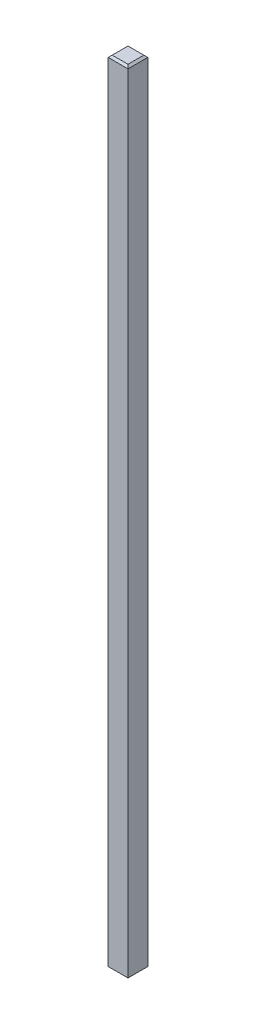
ISO-10303-21;
HEADER;
FILE_DESCRIPTION(('STEP AP214'),'2;1');
FILE_NAME('part.step','',(''),(''),'','','');
FILE_SCHEMA(('AUTOMOTIVE_DESIGN { 1 0 10303 214 1 1 1 1 }'));
ENDSEC;
DATA;
#1=APPLICATION_CONTEXT('core data for automotive mechanical design processes');
#2=APPLICATION_PROTOCOL_DEFINITION('international standard','automotive_design',2000,#1);
#3=PRODUCT_CONTEXT('',#1,'mechanical');
#4=PRODUCT('Part','Part','',(#3));
#5=PRODUCT_RELATED_PRODUCT_CATEGORY('part','',(#4));
#6=PRODUCT_DEFINITION_FORMATION('','',#4);
#7=PRODUCT_DEFINITION_CONTEXT('part definition',#1,'design');
#8=PRODUCT_DEFINITION('design','',#6,#7);
#9=PRODUCT_DEFINITION_SHAPE('','',#8);
#10=(LENGTH_UNIT() NAMED_UNIT(*) SI_UNIT(.MILLI.,.METRE.));
#11=(NAMED_UNIT(*) PLANE_ANGLE_UNIT() SI_UNIT($,.RADIAN.));
#12=(NAMED_UNIT(*) SI_UNIT($,.STERADIAN.) SOLID_ANGLE_UNIT());
#13=UNCERTAINTY_MEASURE_WITH_UNIT(LENGTH_MEASURE(1.E-05),#10,'distance_accuracy_value','');
#14=(GEOMETRIC_REPRESENTATION_CONTEXT(3) GLOBAL_UNCERTAINTY_ASSIGNED_CONTEXT((#13)) GLOBAL_UNIT_ASSIGNED_CONTEXT((#10,
#11,#12)) REPRESENTATION_CONTEXT('',''));
#15=CARTESIAN_POINT('',(0.,0.,0.));
#16=DIRECTION('',(0.,0.,1.));
#17=DIRECTION('',(1.,0.,0.));
#18=AXIS2_PLACEMENT_3D('',#15,#16,#17);
#19=CARTESIAN_POINT('',(0.,0.,10.));
#20=DIRECTION('',(1.,0.,0.));
#21=DIRECTION('',(0.,0.,-1.));
#22=AXIS2_PLACEMENT_3D('',#19,#20,#21);
#23=PLANE('',#22);
#24=DIRECTION('',(0.,-1.,0.));
#25=VECTOR('',#24,1.);
#26=CARTESIAN_POINT('',(0.,0.,10.));
#27=LINE('',#26,#25);
#28=CARTESIAN_POINT('',(0.,399.,10.));
#29=VERTEX_POINT('',#28);
#30=CARTESIAN_POINT('',(0.,1.,10.));
#31=VERTEX_POINT('',#30);
#32=EDGE_CURVE('E210',#29,#31,#27,.T.);
#33=ORIENTED_EDGE('',*,*,#32,.F.);
#34=DIRECTION('',(0.,0.,-1.));
#35=VECTOR('',#34,1.);
#36=CARTESIAN_POINT('',(0.,399.,10.));
#37=LINE('',#36,#35);
#38=CARTESIAN_POINT('',(0.,399.,0.));
#39=VERTEX_POINT('',#38);
#40=EDGE_CURVE('E154',#29,#39,#37,.T.);
#41=ORIENTED_EDGE('',*,*,#40,.T.);
#42=DIRECTION('',(0.,-1.,0.));
#43=VECTOR('',#42,1.);
#44=CARTESIAN_POINT('',(0.,0.,0.));
#45=LINE('',#44,#43);
#46=CARTESIAN_POINT('',(0.,1.,0.));
#47=VERTEX_POINT('',#46);
#48=EDGE_CURVE('E178',#39,#47,#45,.T.);
#49=ORIENTED_EDGE('',*,*,#48,.T.);
#50=DIRECTION('',(0.,0.,1.));
#51=VECTOR('',#50,1.);
#52=CARTESIAN_POINT('',(0.,1.,10.));
#53=LINE('',#52,#51);
#54=EDGE_CURVE('E150',#47,#31,#53,.T.);
#55=ORIENTED_EDGE('',*,*,#54,.T.);
#56=EDGE_LOOP('',(#33,#41,#49,#55));
#57=FACE_BOUND('',#56,.T.);
#58=ADVANCED_FACE('F39',(#57),#23,.F.);
#59=CARTESIAN_POINT('',(0.,0.,10.));
#60=DIRECTION('',(0.,1.,0.));
#61=DIRECTION('',(0.,0.,1.));
#62=AXIS2_PLACEMENT_3D('',#59,#60,#61);
#63=PLANE('',#62);
#64=DIRECTION('',(-1.,0.,0.));
#65=VECTOR('',#64,1.);
#66=CARTESIAN_POINT('',(0.,0.,9.));
#67=LINE('',#66,#65);
#68=CARTESIAN_POINT('',(9.,0.,9.));
#69=VERTEX_POINT('',#68);
#70=CARTESIAN_POINT('',(1.,0.,9.));
#71=VERTEX_POINT('',#70);
#72=EDGE_CURVE('E49',#69,#71,#67,.T.);
#73=ORIENTED_EDGE('',*,*,#72,.T.);
#74=DIRECTION('',(0.,0.,-1.));
#75=VECTOR('',#74,1.);
#76=CARTESIAN_POINT('',(1.,0.,10.));
#77=LINE('',#76,#75);
#78=CARTESIAN_POINT('',(1.,0.,1.));
#79=VERTEX_POINT('',#78);
#80=EDGE_CURVE('E11',#71,#79,#77,.T.);
#81=ORIENTED_EDGE('',*,*,#80,.T.);
#82=DIRECTION('',(1.,0.,0.));
#83=VECTOR('',#82,1.);
#84=CARTESIAN_POINT('',(10.,0.,1.));
#85=LINE('',#84,#83);
#86=CARTESIAN_POINT('',(9.,0.,1.));
#87=VERTEX_POINT('',#86);
#88=EDGE_CURVE('E163',#79,#87,#85,.T.);
#89=ORIENTED_EDGE('',*,*,#88,.T.);
#90=DIRECTION('',(0.,0.,1.));
#91=VECTOR('',#90,1.);
#92=CARTESIAN_POINT('',(9.,0.,10.));
#93=LINE('',#92,#91);
#94=EDGE_CURVE('E60',#87,#69,#93,.T.);
#95=ORIENTED_EDGE('',*,*,#94,.T.);
#96=EDGE_LOOP('',(#73,#81,#89,#95));
#97=FACE_BOUND('',#96,.T.);
#98=ADVANCED_FACE('F237',(#97),#63,.F.);
#99=CARTESIAN_POINT('',(10.,0.,10.));
#100=DIRECTION('',(-1.,0.,0.));
#101=DIRECTION('',(0.,0.,1.));
#102=AXIS2_PLACEMENT_3D('',#99,#100,#101);
#103=PLANE('',#102);
#104=DIRECTION('',(0.,1.,0.));
#105=VECTOR('',#104,1.);
#106=CARTESIAN_POINT('',(10.,0.,0.));
#107=LINE('',#106,#105);
#108=CARTESIAN_POINT('',(10.,1.,0.));
#109=VERTEX_POINT('',#108);
#110=CARTESIAN_POINT('',(10.,399.,0.));
#111=VERTEX_POINT('',#110);
#112=EDGE_CURVE('E203',#109,#111,#107,.T.);
#113=ORIENTED_EDGE('',*,*,#112,.T.);
#114=DIRECTION('',(0.,0.,1.));
#115=VECTOR('',#114,1.);
#116=CARTESIAN_POINT('',(10.,399.,10.));
#117=LINE('',#116,#115);
#118=CARTESIAN_POINT('',(10.,399.,10.));
#119=VERTEX_POINT('',#118);
#120=EDGE_CURVE('E112',#111,#119,#117,.T.);
#121=ORIENTED_EDGE('',*,*,#120,.T.);
#122=DIRECTION('',(0.,1.,0.));
#123=VECTOR('',#122,1.);
#124=CARTESIAN_POINT('',(10.,0.,10.));
#125=LINE('',#124,#123);
#126=CARTESIAN_POINT('',(10.,1.,10.));
#127=VERTEX_POINT('',#126);
#128=EDGE_CURVE('E127',#127,#119,#125,.T.);
#129=ORIENTED_EDGE('',*,*,#128,.F.);
#130=DIRECTION('',(0.,0.,-1.));
#131=VECTOR('',#130,1.);
#132=CARTESIAN_POINT('',(10.,1.,10.));
#133=LINE('',#132,#131);
#134=EDGE_CURVE('E134',#127,#109,#133,.T.);
#135=ORIENTED_EDGE('',*,*,#134,.T.);
#136=EDGE_LOOP('',(#113,#121,#129,#135));
#137=FACE_BOUND('',#136,.T.);
#138=ADVANCED_FACE('F202',(#137),#103,.F.);
#139=CARTESIAN_POINT('',(0.,400.,10.));
#140=DIRECTION('',(0.,-1.,0.));
#141=DIRECTION('',(0.,0.,-1.));
#142=AXIS2_PLACEMENT_3D('',#139,#140,#141);
#143=PLANE('',#142);
#144=DIRECTION('',(1.,0.,0.));
#145=VECTOR('',#144,1.);
#146=CARTESIAN_POINT('',(0.,400.,9.));
#147=LINE('',#146,#145);
#148=CARTESIAN_POINT('',(1.,400.,9.));
#149=VERTEX_POINT('',#148);
#150=CARTESIAN_POINT('',(9.,400.,9.));
#151=VERTEX_POINT('',#150);
#152=EDGE_CURVE('E131',#149,#151,#147,.T.);
#153=ORIENTED_EDGE('',*,*,#152,.T.);
#154=DIRECTION('',(0.,0.,-1.));
#155=VECTOR('',#154,1.);
#156=CARTESIAN_POINT('',(9.,400.,10.));
#157=LINE('',#156,#155);
#158=CARTESIAN_POINT('',(9.,400.,1.));
#159=VERTEX_POINT('',#158);
#160=EDGE_CURVE('E110',#151,#159,#157,.T.);
#161=ORIENTED_EDGE('',*,*,#160,.T.);
#162=DIRECTION('',(-1.,0.,0.));
#163=VECTOR('',#162,1.);
#164=CARTESIAN_POINT('',(0.,400.,1.));
#165=LINE('',#164,#163);
#166=CARTESIAN_POINT('',(1.,400.,1.));
#167=VERTEX_POINT('',#166);
#168=EDGE_CURVE('E119',#159,#167,#165,.T.);
#169=ORIENTED_EDGE('',*,*,#168,.T.);
#170=DIRECTION('',(0.,0.,1.));
#171=VECTOR('',#170,1.);
#172=CARTESIAN_POINT('',(1.,400.,10.));
#173=LINE('',#172,#171);
#174=EDGE_CURVE('E126',#167,#149,#173,.T.);
#175=ORIENTED_EDGE('',*,*,#174,.T.);
#176=EDGE_LOOP('',(#153,#161,#169,#175));
#177=FACE_BOUND('',#176,.T.);
#178=ADVANCED_FACE('F129',(#177),#143,.F.);
#179=CARTESIAN_POINT('',(0.,0.,10.));
#180=DIRECTION('',(0.,0.,-1.));
#181=DIRECTION('',(-1.,0.,0.));
#182=AXIS2_PLACEMENT_3D('',#179,#180,#181);
#183=PLANE('',#182);
#184=ORIENTED_EDGE('',*,*,#128,.T.);
#185=DIRECTION('',(-1.,0.,0.));
#186=VECTOR('',#185,1.);
#187=CARTESIAN_POINT('',(0.,399.,10.));
#188=LINE('',#187,#186);
#189=EDGE_CURVE('E147',#119,#29,#188,.T.);
#190=ORIENTED_EDGE('',*,*,#189,.T.);
#191=ORIENTED_EDGE('',*,*,#32,.T.);
#192=DIRECTION('',(1.,0.,0.));
#193=VECTOR('',#192,1.);
#194=CARTESIAN_POINT('',(0.,1.,10.));
#195=LINE('',#194,#193);
#196=EDGE_CURVE('E144',#31,#127,#195,.T.);
#197=ORIENTED_EDGE('',*,*,#196,.T.);
#198=EDGE_LOOP('',(#184,#190,#191,#197));
#199=FACE_BOUND('',#198,.T.);
#200=ADVANCED_FACE('F228',(#199),#183,.F.);
#201=CARTESIAN_POINT('',(0.,0.,0.));
#202=DIRECTION('',(0.,0.,-1.));
#203=DIRECTION('',(-1.,0.,0.));
#204=AXIS2_PLACEMENT_3D('',#201,#202,#203);
#205=PLANE('',#204);
#206=ORIENTED_EDGE('',*,*,#48,.F.);
#207=DIRECTION('',(1.,0.,0.));
#208=VECTOR('',#207,1.);
#209=CARTESIAN_POINT('',(10.,399.,0.));
#210=LINE('',#209,#208);
#211=EDGE_CURVE('E160',#39,#111,#210,.T.);
#212=ORIENTED_EDGE('',*,*,#211,.T.);
#213=ORIENTED_EDGE('',*,*,#112,.F.);
#214=DIRECTION('',(-1.,0.,0.));
#215=VECTOR('',#214,1.);
#216=CARTESIAN_POINT('',(0.,1.,0.));
#217=LINE('',#216,#215);
#218=EDGE_CURVE('E157',#109,#47,#217,.T.);
#219=ORIENTED_EDGE('',*,*,#218,.T.);
#220=EDGE_LOOP('',(#206,#212,#213,#219));
#221=FACE_BOUND('',#220,.T.);
#222=ADVANCED_FACE('F207',(#221),#205,.T.);
#223=CARTESIAN_POINT('',(0.,399.,10.));
#224=DIRECTION('',(0.707106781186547,-0.707106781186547,0.));
#225=DIRECTION('',(0.,0.,-1.));
#226=AXIS2_PLACEMENT_3D('',#223,#224,#225);
#227=PLANE('',#226);
#228=DIRECTION('',(-0.577350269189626,-0.577350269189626,-0.577350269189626));
#229=VECTOR('',#228,1.);
#230=CARTESIAN_POINT('',(0.666666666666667,399.666666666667,0.666666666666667));
#231=LINE('',#230,#229);
#232=EDGE_CURVE('E122',#39,#167,#231,.F.);
#233=ORIENTED_EDGE('',*,*,#232,.F.);
#234=ORIENTED_EDGE('',*,*,#40,.F.);
#235=DIRECTION('',(0.577350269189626,0.577350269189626,-0.577350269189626));
#236=VECTOR('',#235,1.);
#237=CARTESIAN_POINT('',(0.,399.,10.));
#238=LINE('',#237,#236);
#239=EDGE_CURVE('E174',#149,#29,#238,.F.);
#240=ORIENTED_EDGE('',*,*,#239,.F.);
#241=ORIENTED_EDGE('',*,*,#174,.F.);
#242=EDGE_LOOP('',(#233,#234,#240,#241));
#243=FACE_BOUND('',#242,.T.);
#244=ADVANCED_FACE('F222',(#243),#227,.F.);
#245=CARTESIAN_POINT('',(0.,399.,10.));
#246=DIRECTION('',(0.,-0.707106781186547,-0.707106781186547));
#247=DIRECTION('',(-1.,0.,0.));
#248=AXIS2_PLACEMENT_3D('',#245,#246,#247);
#249=PLANE('',#248);
#250=ORIENTED_EDGE('',*,*,#239,.T.);
#251=ORIENTED_EDGE('',*,*,#189,.F.);
#252=DIRECTION('',(-0.577350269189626,0.577350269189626,-0.577350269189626));
#253=VECTOR('',#252,1.);
#254=CARTESIAN_POINT('',(6.66666666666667,402.333333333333,6.66666666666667));
#255=LINE('',#254,#253);
#256=EDGE_CURVE('E116',#151,#119,#255,.F.);
#257=ORIENTED_EDGE('',*,*,#256,.F.);
#258=ORIENTED_EDGE('',*,*,#152,.F.);
#259=EDGE_LOOP('',(#250,#251,#257,#258));
#260=FACE_BOUND('',#259,.T.);
#261=ADVANCED_FACE('F225',(#260),#249,.F.);
#262=CARTESIAN_POINT('',(0.,400.,1.));
#263=DIRECTION('',(0.,0.707106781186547,-0.707106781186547));
#264=DIRECTION('',(1.,0.,0.));
#265=AXIS2_PLACEMENT_3D('',#262,#263,#264);
#266=PLANE('',#265);
#267=ORIENTED_EDGE('',*,*,#232,.T.);
#268=ORIENTED_EDGE('',*,*,#168,.F.);
#269=DIRECTION('',(-0.577350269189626,0.577350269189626,0.577350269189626));
#270=VECTOR('',#269,1.);
#271=CARTESIAN_POINT('',(6.,403.,4.));
#272=LINE('',#271,#270);
#273=EDGE_CURVE('E106',#111,#159,#272,.T.);
#274=ORIENTED_EDGE('',*,*,#273,.F.);
#275=ORIENTED_EDGE('',*,*,#211,.F.);
#276=EDGE_LOOP('',(#267,#268,#274,#275));
#277=FACE_BOUND('',#276,.T.);
#278=ADVANCED_FACE('F120',(#277),#266,.T.);
#279=CARTESIAN_POINT('',(9.,400.,10.));
#280=DIRECTION('',(-0.707106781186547,-0.707106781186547,0.));
#281=DIRECTION('',(0.,0.,-1.));
#282=AXIS2_PLACEMENT_3D('',#279,#280,#281);
#283=PLANE('',#282);
#284=ORIENTED_EDGE('',*,*,#256,.T.);
#285=ORIENTED_EDGE('',*,*,#120,.F.);
#286=ORIENTED_EDGE('',*,*,#273,.T.);
#287=ORIENTED_EDGE('',*,*,#160,.F.);
#288=EDGE_LOOP('',(#284,#285,#286,#287));
#289=FACE_BOUND('',#288,.T.);
#290=ADVANCED_FACE('F108',(#289),#283,.F.);
#291=CARTESIAN_POINT('',(10.,1.,10.));
#292=DIRECTION('',(-0.707106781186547,0.707106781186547,0.));
#293=DIRECTION('',(0.,0.,-1.));
#294=AXIS2_PLACEMENT_3D('',#291,#292,#293);
#295=PLANE('',#294);
#296=DIRECTION('',(0.577350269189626,0.577350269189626,-0.577350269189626));
#297=VECTOR('',#296,1.);
#298=CARTESIAN_POINT('',(6.,-3.,4.));
#299=LINE('',#298,#297);
#300=EDGE_CURVE('E184',#109,#87,#299,.F.);
#301=ORIENTED_EDGE('',*,*,#300,.F.);
#302=ORIENTED_EDGE('',*,*,#134,.F.);
#303=DIRECTION('',(-0.577350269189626,-0.577350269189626,-0.577350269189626));
#304=VECTOR('',#303,1.);
#305=CARTESIAN_POINT('',(10.,1.,10.));
#306=LINE('',#305,#304);
#307=EDGE_CURVE('E43',#69,#127,#306,.F.);
#308=ORIENTED_EDGE('',*,*,#307,.F.);
#309=ORIENTED_EDGE('',*,*,#94,.F.);
#310=EDGE_LOOP('',(#301,#302,#308,#309));
#311=FACE_BOUND('',#310,.T.);
#312=ADVANCED_FACE('F41',(#311),#295,.F.);
#313=CARTESIAN_POINT('',(0.,1.,10.));
#314=DIRECTION('',(0.,0.707106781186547,-0.707106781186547));
#315=DIRECTION('',(1.,0.,0.));
#316=AXIS2_PLACEMENT_3D('',#313,#314,#315);
#317=PLANE('',#316);
#318=ORIENTED_EDGE('',*,*,#307,.T.);
#319=ORIENTED_EDGE('',*,*,#196,.F.);
#320=DIRECTION('',(0.577350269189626,-0.577350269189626,-0.577350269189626));
#321=VECTOR('',#320,1.);
#322=CARTESIAN_POINT('',(0.,1.,10.));
#323=LINE('',#322,#321);
#324=EDGE_CURVE('E182',#71,#31,#323,.F.);
#325=ORIENTED_EDGE('',*,*,#324,.F.);
#326=ORIENTED_EDGE('',*,*,#72,.F.);
#327=EDGE_LOOP('',(#318,#319,#325,#326));
#328=FACE_BOUND('',#327,.T.);
#329=ADVANCED_FACE('F195',(#328),#317,.F.);
#330=CARTESIAN_POINT('',(0.,0.,1.));
#331=DIRECTION('',(0.,-0.707106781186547,-0.707106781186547));
#332=DIRECTION('',(-1.,0.,0.));
#333=AXIS2_PLACEMENT_3D('',#330,#331,#332);
#334=PLANE('',#333);
#335=ORIENTED_EDGE('',*,*,#300,.T.);
#336=ORIENTED_EDGE('',*,*,#88,.F.);
#337=DIRECTION('',(0.577350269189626,-0.577350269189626,0.577350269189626));
#338=VECTOR('',#337,1.);
#339=CARTESIAN_POINT('',(0.666666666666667,0.333333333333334,0.666666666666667));
#340=LINE('',#339,#338);
#341=EDGE_CURVE('E179',#47,#79,#340,.T.);
#342=ORIENTED_EDGE('',*,*,#341,.F.);
#343=ORIENTED_EDGE('',*,*,#218,.F.);
#344=EDGE_LOOP('',(#335,#336,#342,#343));
#345=FACE_BOUND('',#344,.T.);
#346=ADVANCED_FACE('F236',(#345),#334,.T.);
#347=CARTESIAN_POINT('',(1.,0.,10.));
#348=DIRECTION('',(0.707106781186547,0.707106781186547,0.));
#349=DIRECTION('',(0.,0.,-1.));
#350=AXIS2_PLACEMENT_3D('',#347,#348,#349);
#351=PLANE('',#350);
#352=ORIENTED_EDGE('',*,*,#324,.T.);
#353=ORIENTED_EDGE('',*,*,#54,.F.);
#354=ORIENTED_EDGE('',*,*,#341,.T.);
#355=ORIENTED_EDGE('',*,*,#80,.F.);
#356=EDGE_LOOP('',(#352,#353,#354,#355));
#357=FACE_BOUND('',#356,.T.);
#358=ADVANCED_FACE('F234',(#357),#351,.F.);
#359=CLOSED_SHELL('',(#58,#98,#138,#178,#200,#222,#244,#261,#278,#290,#312,#329,#346,#358));
#360=MANIFOLD_SOLID_BREP('B2',#359);
#361=ADVANCED_BREP_SHAPE_REPRESENTATION('',(#18,#360),#14);
#362=SHAPE_DEFINITION_REPRESENTATION(#9,#361);
ENDSEC;
END-ISO-10303-21;
